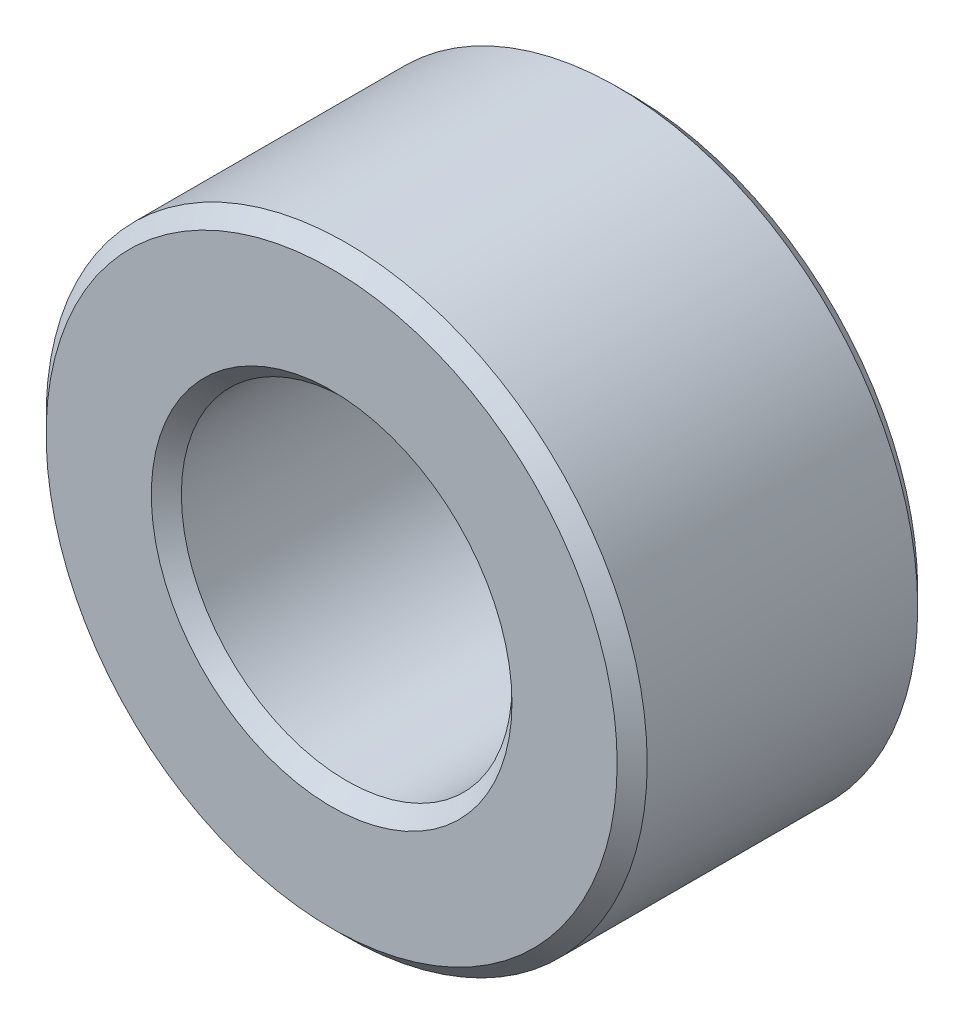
from build123d import *

# Parameters (mm, degrees)
SKETCH1_R           = 2
SKETCH1_R_2         = 1.1
BOSS_EXTRUDE2_DEPTH = 1
CHAMFER3_SIZE       = 0.1


with BuildPart() as part:
    # Sketch1 → Boss-Extrude2 (new, symmetric)
    with BuildSketch(Plane.XY):
        Circle(SKETCH1_R)
        Circle(SKETCH1_R_2, mode=Mode.SUBTRACT)
    extrude(amount=BOSS_EXTRUDE2_DEPTH, both=True)

    # Chamfer3
    chamfer3_edges = [part.edges().sort_by_distance(p)[0] for p in [
        (-2, 0, -1),
        (-2, 0, 1),
        (-1.1, 0, -1),
        (-1.1, 0, 1),
    ]]
    chamfer(chamfer3_edges, length=CHAMFER3_SIZE)


solid = part.part
